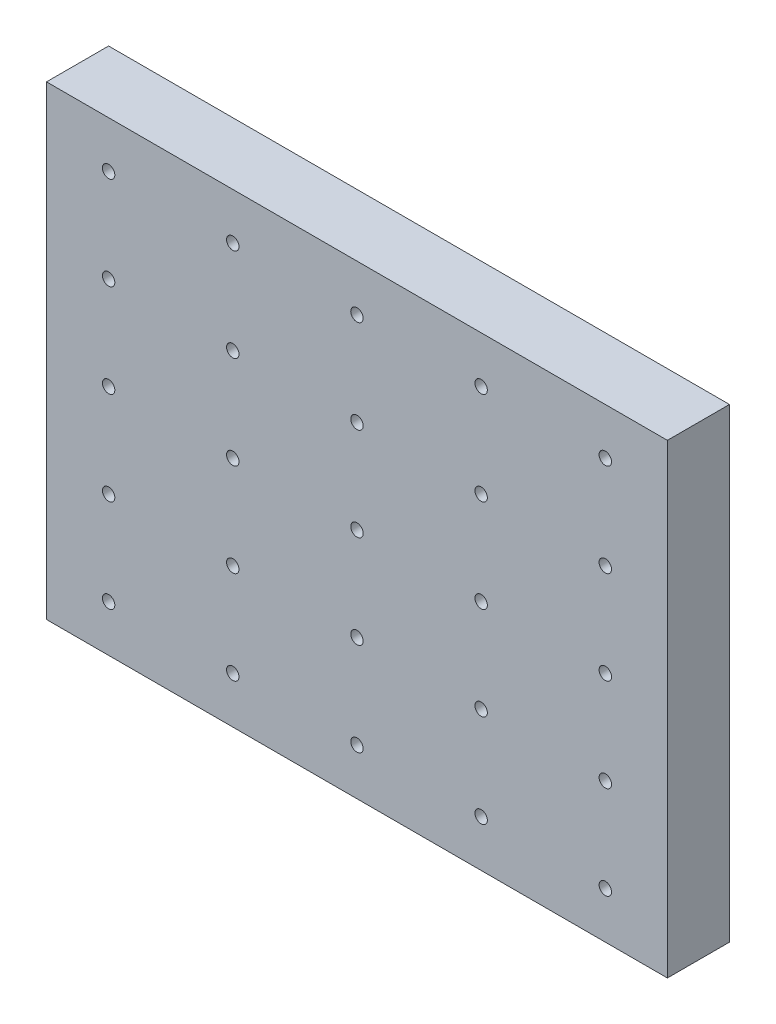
from build123d import *

# Parameters (mm, degrees)
ESQUISSE1_W                     = 200
ESQUISSE1_H                     = 150
BOSS_EXTRU_1_DEPTH              = 20
ESQUISSE4_R                     = 2
ENL_V_MAT_EXTRU_2_DEPTH         = 20
R_P_TITION_LIN_AIRE1_COUNT      = 5
R_P_TITION_LIN_AIRE1_PITCH      = 40
R_P_TITION_LIN_AIRE1_COUNT_DIR2 = 5
R_P_TITION_LIN_AIRE1_PITCH_DIR2 = 30


with BuildPart() as part:
    # Esquisse1 → Boss.-Extru.1 (new body)
    with BuildSketch(Plane.XY):
        with Locations((100, 75)):
            Rectangle(ESQUISSE1_W, ESQUISSE1_H)
    extrude(amount=BOSS_EXTRU_1_DEPTH)

    # Esquisse4 → Enl_v. mat.-Extru.2 (cut)
    with BuildSketch(Plane(origin=(0, 0, 0), x_dir=(-1, 0, 0), z_dir=(0, 0, -1))):
        with Locations((-20, 15)):
            Circle(ESQUISSE4_R)
    enl_v_mat_extru_2 = extrude(amount=-ENL_V_MAT_EXTRU_2_DEPTH, mode=Mode.SUBTRACT)

    # R_p_tition lin_aire1: Enl_v. mat.-Extru.2 5 × 5
    with Locations(*[(i * R_P_TITION_LIN_AIRE1_PITCH, j * R_P_TITION_LIN_AIRE1_PITCH_DIR2, 0) for i in range(R_P_TITION_LIN_AIRE1_COUNT) for j in range(R_P_TITION_LIN_AIRE1_COUNT_DIR2) if (i, j) != (0, 0)]):
        add(enl_v_mat_extru_2, mode=Mode.SUBTRACT)


solid = part.part
